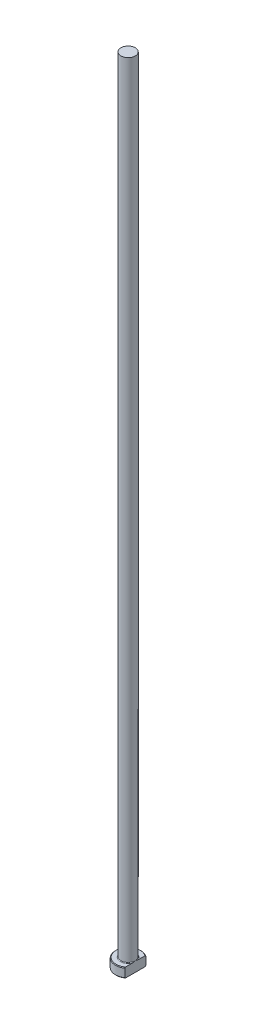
from build123d import *
from build123d.topology import SkipClean

# Parameters (mm, degrees)
CHAMFER1_SIZE = 0.2
FILLET1_R     = 0.2
KEY_DEPTH     = 251.06399181


with BuildPart() as part:
    # Sketch1 → Revolve1 (revolve)
    with BuildSketch(Plane.XY, mode=Mode.PRIVATE) as revolve1_sk:
        Polygon((0, 0), (-4, 0), (-4, 3), (-2.25, 3), (-2.25, 250), (0, 250), align=None)
    revolve(revolve1_sk.sketch.rotate(Axis((0, 259.958771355, 0), (0, -1, 0)), 270), axis=Axis((0, 259.958771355, 0), (0, -1, 0)))

    # Chamfer1
    chamfer1_edges = [part.edges().sort_by_distance(p)[0] for p in [
        (0, 3, -4),
        (0, 0, -4),
    ]]
    chamfer(chamfer1_edges, length=CHAMFER1_SIZE)

    # Fillet1
    fillet1_edges = [part.edges().sort_by_distance(p)[0] for p in [
        (0, 3, -2.25),
    ]]
    fillet(fillet1_edges, radius=FILLET1_R)

    # Sketch2 → KEY (cut, through all)
    with SkipClean():  # the faces are left unmerged after this step: merging them gives an invalid solid
        with BuildSketch(Plane(origin=(0, 0, 0), x_dir=(1, 0, 0), z_dir=(0, 1, 0))):
            with BuildLine():
                Line((2.25, 3.307189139), (2.25, -3.307189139))
                ThreePointArc((2.25, -3.307189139), (4, 0), (2.25, 3.307189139))
            make_face()
        extrude(amount=KEY_DEPTH, mode=Mode.SUBTRACT)


solid = part.part
